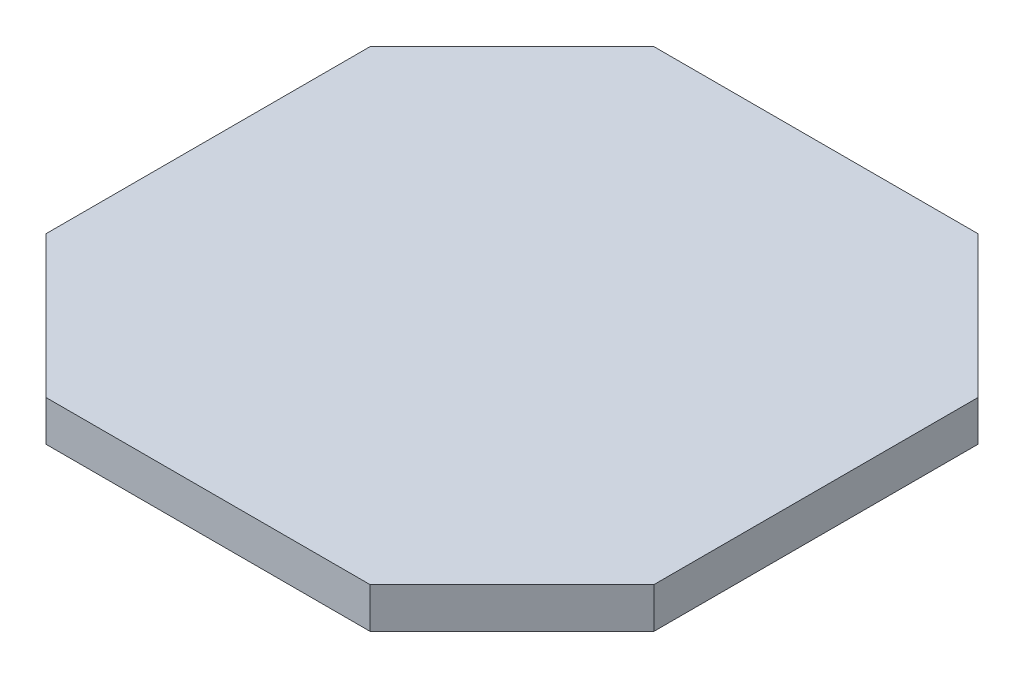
from build123d import *

# Parameters (mm, degrees)
EXTRUDE1_DEPTH = 2.54


with BuildPart() as part:
    # Sketch1 → Extrude1 (new body)
    with BuildSketch(Plane(origin=(0, 0, 0), x_dir=(1, 0, 0), z_dir=(0, 1, 0))):
        Polygon((10.16, -19.05), (19.05, -10.16), (19.05, 0), (19.05, 10.16), (10.16, 19.05), (-10.16, 19.05), (-19.05, 10.16), (-19.05, 0), (-19.05, -10.16), (-10.16, -19.05), align=None)
    extrude(amount=EXTRUDE1_DEPTH)


solid = part.part
